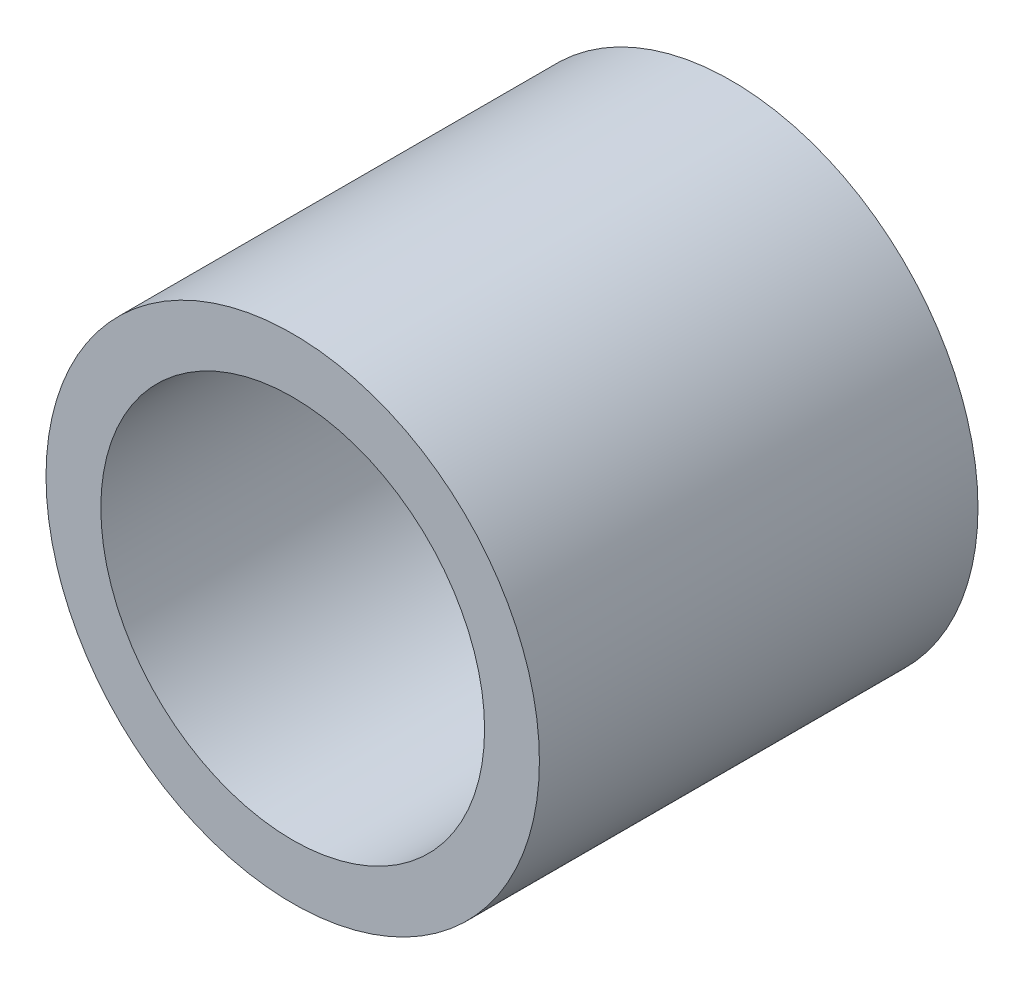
ISO-10303-21;
HEADER;
FILE_DESCRIPTION(('STEP AP214'),'2;1');
FILE_NAME('part.step','',(''),(''),'','','');
FILE_SCHEMA(('AUTOMOTIVE_DESIGN { 1 0 10303 214 1 1 1 1 }'));
ENDSEC;
DATA;
#1=APPLICATION_CONTEXT('core data for automotive mechanical design processes');
#2=APPLICATION_PROTOCOL_DEFINITION('international standard','automotive_design',2000,#1);
#3=PRODUCT_CONTEXT('',#1,'mechanical');
#4=PRODUCT('Part','Part','',(#3));
#5=PRODUCT_RELATED_PRODUCT_CATEGORY('part','',(#4));
#6=PRODUCT_DEFINITION_FORMATION('','',#4);
#7=PRODUCT_DEFINITION_CONTEXT('part definition',#1,'design');
#8=PRODUCT_DEFINITION('design','',#6,#7);
#9=PRODUCT_DEFINITION_SHAPE('','',#8);
#10=(LENGTH_UNIT() NAMED_UNIT(*) SI_UNIT(.MILLI.,.METRE.));
#11=(NAMED_UNIT(*) PLANE_ANGLE_UNIT() SI_UNIT($,.RADIAN.));
#12=(NAMED_UNIT(*) SI_UNIT($,.STERADIAN.) SOLID_ANGLE_UNIT());
#13=UNCERTAINTY_MEASURE_WITH_UNIT(LENGTH_MEASURE(1.E-05),#10,'distance_accuracy_value','');
#14=(GEOMETRIC_REPRESENTATION_CONTEXT(3) GLOBAL_UNCERTAINTY_ASSIGNED_CONTEXT((#13)) GLOBAL_UNIT_ASSIGNED_CONTEXT((#10,
#11,#12)) REPRESENTATION_CONTEXT('',''));
#15=CARTESIAN_POINT('',(0.,0.,0.));
#16=DIRECTION('',(0.,0.,1.));
#17=DIRECTION('',(1.,0.,0.));
#18=AXIS2_PLACEMENT_3D('',#15,#16,#17);
#19=CARTESIAN_POINT('',(0.,0.,8.));
#20=DIRECTION('',(0.,0.,1.));
#21=DIRECTION('',(1.,0.,0.));
#22=AXIS2_PLACEMENT_3D('',#19,#20,#21);
#23=PLANE('',#22);
#24=CARTESIAN_POINT('',(0.,0.,8.));
#25=DIRECTION('',(0.,0.,1.));
#26=DIRECTION('',(1.,0.,0.));
#27=AXIS2_PLACEMENT_3D('',#24,#25,#26);
#28=CIRCLE('',#27,4.5);
#29=CARTESIAN_POINT('',(4.5,0.,8.));
#30=VERTEX_POINT('',#29);
#31=EDGE_CURVE('E10',#30,#30,#28,.T.);
#32=ORIENTED_EDGE('',*,*,#31,.T.);
#33=EDGE_LOOP('',(#32));
#34=FACE_BOUND('',#33,.T.);
#35=CARTESIAN_POINT('',(0.,0.,8.));
#36=DIRECTION('',(0.,0.,1.));
#37=DIRECTION('',(1.,0.,0.));
#38=AXIS2_PLACEMENT_3D('',#35,#36,#37);
#39=CIRCLE('',#38,3.5);
#40=CARTESIAN_POINT('',(3.5,0.,8.));
#41=VERTEX_POINT('',#40);
#42=EDGE_CURVE('E40',#41,#41,#39,.T.);
#43=ORIENTED_EDGE('',*,*,#42,.F.);
#44=EDGE_LOOP('',(#43));
#45=FACE_BOUND('',#44,.T.);
#46=ADVANCED_FACE('F29',(#34,#45),#23,.T.);
#47=CARTESIAN_POINT('',(0.,0.,0.));
#48=DIRECTION('',(0.,0.,1.));
#49=DIRECTION('',(1.,0.,0.));
#50=AXIS2_PLACEMENT_3D('',#47,#48,#49);
#51=PLANE('',#50);
#52=CARTESIAN_POINT('',(0.,0.,0.));
#53=DIRECTION('',(0.,0.,1.));
#54=DIRECTION('',(1.,0.,0.));
#55=AXIS2_PLACEMENT_3D('',#52,#53,#54);
#56=CIRCLE('',#55,4.5);
#57=CARTESIAN_POINT('',(4.5,0.,0.));
#58=VERTEX_POINT('',#57);
#59=EDGE_CURVE('E36',#58,#58,#56,.T.);
#60=ORIENTED_EDGE('',*,*,#59,.F.);
#61=EDGE_LOOP('',(#60));
#62=FACE_BOUND('',#61,.T.);
#63=CARTESIAN_POINT('',(0.,0.,0.));
#64=DIRECTION('',(0.,0.,1.));
#65=DIRECTION('',(1.,0.,0.));
#66=AXIS2_PLACEMENT_3D('',#63,#64,#65);
#67=CIRCLE('',#66,3.5);
#68=CARTESIAN_POINT('',(3.5,0.,0.));
#69=VERTEX_POINT('',#68);
#70=EDGE_CURVE('E44',#69,#69,#67,.T.);
#71=ORIENTED_EDGE('',*,*,#70,.T.);
#72=EDGE_LOOP('',(#71));
#73=FACE_BOUND('',#72,.T.);
#74=ADVANCED_FACE('F50',(#62,#73),#51,.F.);
#75=CARTESIAN_POINT('',(0.,0.,8.));
#76=DIRECTION('',(0.,0.,-1.));
#77=DIRECTION('',(-1.,0.,0.));
#78=AXIS2_PLACEMENT_3D('',#75,#76,#77);
#79=CYLINDRICAL_SURFACE('',#78,4.5);
#80=ORIENTED_EDGE('',*,*,#31,.F.);
#81=EDGE_LOOP('',(#80));
#82=FACE_BOUND('',#81,.T.);
#83=ORIENTED_EDGE('',*,*,#59,.T.);
#84=EDGE_LOOP('',(#83));
#85=FACE_BOUND('',#84,.T.);
#86=ADVANCED_FACE('F31',(#82,#85),#79,.T.);
#87=CARTESIAN_POINT('',(0.,0.,8.));
#88=DIRECTION('',(0.,0.,-1.));
#89=DIRECTION('',(-1.,0.,0.));
#90=AXIS2_PLACEMENT_3D('',#87,#88,#89);
#91=CYLINDRICAL_SURFACE('',#90,3.5);
#92=ORIENTED_EDGE('',*,*,#42,.T.);
#93=EDGE_LOOP('',(#92));
#94=FACE_BOUND('',#93,.T.);
#95=ORIENTED_EDGE('',*,*,#70,.F.);
#96=EDGE_LOOP('',(#95));
#97=FACE_BOUND('',#96,.T.);
#98=ADVANCED_FACE('F52',(#94,#97),#91,.F.);
#99=CLOSED_SHELL('',(#46,#74,#86,#98));
#100=MANIFOLD_SOLID_BREP('B2',#99);
#101=ADVANCED_BREP_SHAPE_REPRESENTATION('',(#18,#100),#14);
#102=SHAPE_DEFINITION_REPRESENTATION(#9,#101);
ENDSEC;
END-ISO-10303-21;
